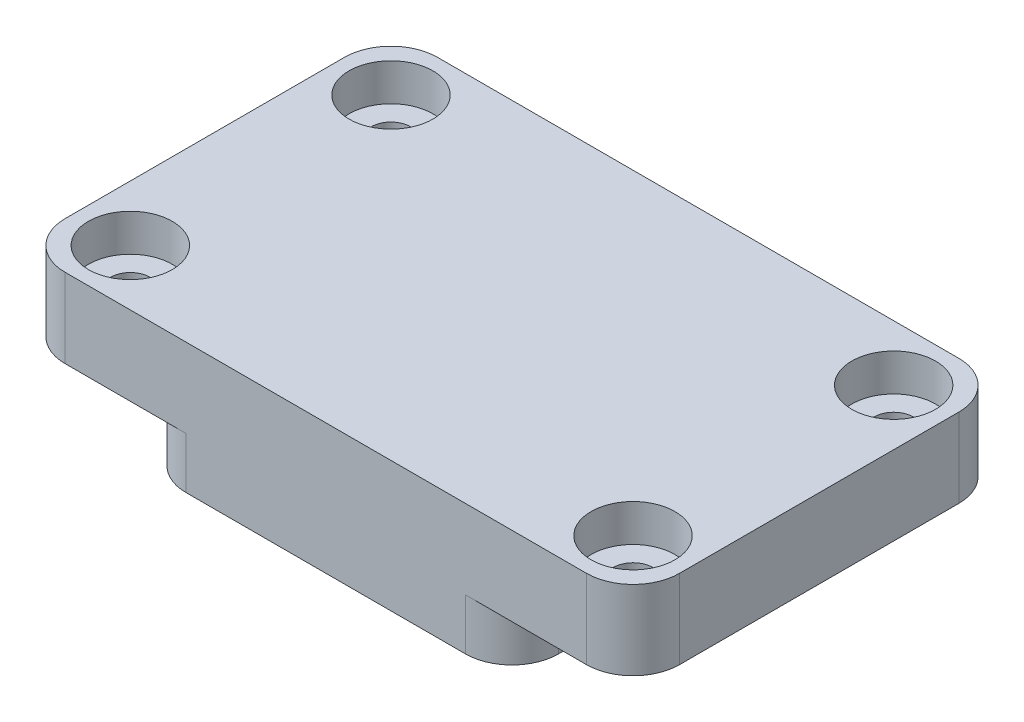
ISO-10303-21;
HEADER;
FILE_DESCRIPTION(('STEP AP214'),'2;1');
FILE_NAME('part.step','',(''),(''),'','','');
FILE_SCHEMA(('AUTOMOTIVE_DESIGN { 1 0 10303 214 1 1 1 1 }'));
ENDSEC;
DATA;
#1=APPLICATION_CONTEXT('core data for automotive mechanical design processes');
#2=APPLICATION_PROTOCOL_DEFINITION('international standard','automotive_design',2000,#1);
#3=PRODUCT_CONTEXT('',#1,'mechanical');
#4=PRODUCT('Part','Part','',(#3));
#5=PRODUCT_RELATED_PRODUCT_CATEGORY('part','',(#4));
#6=PRODUCT_DEFINITION_FORMATION('','',#4);
#7=PRODUCT_DEFINITION_CONTEXT('part definition',#1,'design');
#8=PRODUCT_DEFINITION('design','',#6,#7);
#9=PRODUCT_DEFINITION_SHAPE('','',#8);
#10=(LENGTH_UNIT() NAMED_UNIT(*) SI_UNIT(.MILLI.,.METRE.));
#11=(NAMED_UNIT(*) PLANE_ANGLE_UNIT() SI_UNIT($,.RADIAN.));
#12=(NAMED_UNIT(*) SI_UNIT($,.STERADIAN.) SOLID_ANGLE_UNIT());
#13=UNCERTAINTY_MEASURE_WITH_UNIT(LENGTH_MEASURE(1.E-05),#10,'distance_accuracy_value','');
#14=(GEOMETRIC_REPRESENTATION_CONTEXT(3) GLOBAL_UNCERTAINTY_ASSIGNED_CONTEXT((#13)) GLOBAL_UNIT_ASSIGNED_CONTEXT((#10,
#11,#12)) REPRESENTATION_CONTEXT('',''));
#15=CARTESIAN_POINT('',(0.,0.,0.));
#16=DIRECTION('',(0.,0.,1.));
#17=DIRECTION('',(1.,0.,0.));
#18=AXIS2_PLACEMENT_3D('',#15,#16,#17);
#19=CARTESIAN_POINT('',(-7.5,7.,-7.5));
#20=DIRECTION('',(0.,-1.,0.));
#21=DIRECTION('',(0.,0.,-1.));
#22=AXIS2_PLACEMENT_3D('',#19,#20,#21);
#23=PLANE('',#22);
#24=CARTESIAN_POINT('',(-13.5,7.,7.));
#25=DIRECTION('',(0.,1.,0.));
#26=DIRECTION('',(0.,0.,1.));
#27=AXIS2_PLACEMENT_3D('',#24,#25,#26);
#28=CIRCLE('',#27,2.25);
#29=CARTESIAN_POINT('',(-13.5,7.,9.25));
#30=VERTEX_POINT('',#29);
#31=EDGE_CURVE('E384',#30,#30,#28,.T.);
#32=ORIENTED_EDGE('',*,*,#31,.F.);
#33=EDGE_LOOP('',(#32));
#34=FACE_BOUND('',#33,.T.);
#35=CARTESIAN_POINT('',(-13.5,7.,-7.));
#36=DIRECTION('',(0.,1.,0.));
#37=DIRECTION('',(0.,0.,1.));
#38=AXIS2_PLACEMENT_3D('',#35,#36,#37);
#39=CIRCLE('',#38,2.25);
#40=CARTESIAN_POINT('',(-13.5,7.,-4.75));
#41=VERTEX_POINT('',#40);
#42=EDGE_CURVE('E371',#41,#41,#39,.T.);
#43=ORIENTED_EDGE('',*,*,#42,.F.);
#44=EDGE_LOOP('',(#43));
#45=FACE_BOUND('',#44,.T.);
#46=CARTESIAN_POINT('',(13.5,7.,-7.));
#47=DIRECTION('',(0.,1.,0.));
#48=DIRECTION('',(0.,0.,1.));
#49=AXIS2_PLACEMENT_3D('',#46,#47,#48);
#50=CIRCLE('',#49,2.25);
#51=CARTESIAN_POINT('',(13.5,7.,-4.75));
#52=VERTEX_POINT('',#51);
#53=EDGE_CURVE('E367',#52,#52,#50,.T.);
#54=ORIENTED_EDGE('',*,*,#53,.F.);
#55=EDGE_LOOP('',(#54));
#56=FACE_BOUND('',#55,.T.);
#57=DIRECTION('',(-1.,0.,0.));
#58=VECTOR('',#57,1.);
#59=CARTESIAN_POINT('',(-7.49999999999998,7.,-10.));
#60=LINE('',#59,#58);
#61=CARTESIAN_POINT('',(14.,7.,-10.));
#62=VERTEX_POINT('',#61);
#63=CARTESIAN_POINT('',(-14.,7.,-10.));
#64=VERTEX_POINT('',#63);
#65=EDGE_CURVE('E327',#62,#64,#60,.T.);
#66=ORIENTED_EDGE('',*,*,#65,.T.);
#67=CARTESIAN_POINT('',(-14.,7.,-7.5));
#68=DIRECTION('',(0.,1.,0.));
#69=DIRECTION('',(0.,0.,-1.));
#70=AXIS2_PLACEMENT_3D('',#67,#68,#69);
#71=CIRCLE('',#70,2.5);
#72=CARTESIAN_POINT('',(-16.5,7.,-7.5));
#73=VERTEX_POINT('',#72);
#74=EDGE_CURVE('E241',#64,#73,#71,.T.);
#75=ORIENTED_EDGE('',*,*,#74,.T.);
#76=DIRECTION('',(0.,0.,1.));
#77=VECTOR('',#76,1.);
#78=CARTESIAN_POINT('',(-16.5,7.,-7.5));
#79=LINE('',#78,#77);
#80=CARTESIAN_POINT('',(-16.5,7.,7.50000000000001));
#81=VERTEX_POINT('',#80);
#82=EDGE_CURVE('E273',#73,#81,#79,.T.);
#83=ORIENTED_EDGE('',*,*,#82,.T.);
#84=CARTESIAN_POINT('',(-14.,7.,7.50000000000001));
#85=DIRECTION('',(0.,1.,0.));
#86=DIRECTION('',(0.,0.,1.));
#87=AXIS2_PLACEMENT_3D('',#84,#85,#86);
#88=CIRCLE('',#87,2.5);
#89=CARTESIAN_POINT('',(-14.,7.,10.));
#90=VERTEX_POINT('',#89);
#91=EDGE_CURVE('E250',#81,#90,#88,.T.);
#92=ORIENTED_EDGE('',*,*,#91,.T.);
#93=DIRECTION('',(1.,0.,0.));
#94=VECTOR('',#93,1.);
#95=CARTESIAN_POINT('',(-7.49999999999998,7.,10.));
#96=LINE('',#95,#94);
#97=CARTESIAN_POINT('',(14.,7.,10.));
#98=VERTEX_POINT('',#97);
#99=EDGE_CURVE('E325',#90,#98,#96,.T.);
#100=ORIENTED_EDGE('',*,*,#99,.T.);
#101=CARTESIAN_POINT('',(14.,7.,7.5));
#102=DIRECTION('',(0.,1.,0.));
#103=DIRECTION('',(0.,0.,-1.));
#104=AXIS2_PLACEMENT_3D('',#101,#102,#103);
#105=CIRCLE('',#104,2.5);
#106=CARTESIAN_POINT('',(16.5,7.,7.5));
#107=VERTEX_POINT('',#106);
#108=EDGE_CURVE('E236',#98,#107,#105,.T.);
#109=ORIENTED_EDGE('',*,*,#108,.T.);
#110=DIRECTION('',(0.,0.,-1.));
#111=VECTOR('',#110,1.);
#112=CARTESIAN_POINT('',(16.5,7.,-7.5));
#113=LINE('',#112,#111);
#114=CARTESIAN_POINT('',(16.5,7.,-7.5));
#115=VERTEX_POINT('',#114);
#116=EDGE_CURVE('E193',#107,#115,#113,.T.);
#117=ORIENTED_EDGE('',*,*,#116,.T.);
#118=CARTESIAN_POINT('',(14.,7.,-7.5));
#119=DIRECTION('',(0.,1.,0.));
#120=DIRECTION('',(0.,0.,-1.));
#121=AXIS2_PLACEMENT_3D('',#118,#119,#120);
#122=CIRCLE('',#121,2.5);
#123=EDGE_CURVE('E214',#115,#62,#122,.T.);
#124=ORIENTED_EDGE('',*,*,#123,.T.);
#125=EDGE_LOOP('',(#66,#75,#83,#92,#100,#109,#117,#124));
#126=FACE_BOUND('',#125,.T.);
#127=CARTESIAN_POINT('',(13.5,7.,7.));
#128=DIRECTION('',(0.,1.,0.));
#129=DIRECTION('',(0.,0.,1.));
#130=AXIS2_PLACEMENT_3D('',#127,#128,#129);
#131=CIRCLE('',#130,2.25);
#132=CARTESIAN_POINT('',(13.5,7.,9.25));
#133=VERTEX_POINT('',#132);
#134=EDGE_CURVE('E843',#133,#133,#131,.T.);
#135=ORIENTED_EDGE('',*,*,#134,.F.);
#136=EDGE_LOOP('',(#135));
#137=FACE_BOUND('',#136,.T.);
#138=ADVANCED_FACE('F40',(#34,#45,#56,#126,#137),#23,.F.);
#139=CARTESIAN_POINT('',(-7.5,7.,-7.5));
#140=DIRECTION('',(0.,-1.,0.));
#141=DIRECTION('',(0.,0.,-1.));
#142=AXIS2_PLACEMENT_3D('',#139,#140,#141);
#143=CYLINDRICAL_SURFACE('',#142,2.5);
#144=DIRECTION('',(0.,-1.,0.));
#145=VECTOR('',#144,1.);
#146=CARTESIAN_POINT('',(-10.,7.,-7.49999999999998));
#147=LINE('',#146,#145);
#148=CARTESIAN_POINT('',(-10.,2.75,-7.49999999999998));
#149=VERTEX_POINT('',#148);
#150=CARTESIAN_POINT('',(-10.,0.,-7.49999999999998));
#151=VERTEX_POINT('',#150);
#152=EDGE_CURVE('E11',#149,#151,#147,.T.);
#153=ORIENTED_EDGE('',*,*,#152,.F.);
#154=CARTESIAN_POINT('',(-7.5,2.75,-7.5));
#155=DIRECTION('',(0.,-1.,0.));
#156=DIRECTION('',(0.,0.,1.));
#157=AXIS2_PLACEMENT_3D('',#154,#155,#156);
#158=CIRCLE('',#157,2.5);
#159=CARTESIAN_POINT('',(-7.49999999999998,2.75,-10.));
#160=VERTEX_POINT('',#159);
#161=EDGE_CURVE('E265',#149,#160,#158,.T.);
#162=ORIENTED_EDGE('',*,*,#161,.T.);
#163=DIRECTION('',(0.,-1.,0.));
#164=VECTOR('',#163,1.);
#165=CARTESIAN_POINT('',(-7.49999999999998,7.,-10.));
#166=LINE('',#165,#164);
#167=CARTESIAN_POINT('',(-7.49999999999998,0.,-10.));
#168=VERTEX_POINT('',#167);
#169=EDGE_CURVE('E65',#160,#168,#166,.T.);
#170=ORIENTED_EDGE('',*,*,#169,.T.);
#171=CARTESIAN_POINT('',(-7.5,0.,-7.5));
#172=DIRECTION('',(0.,1.,0.));
#173=DIRECTION('',(0.,0.,-1.));
#174=AXIS2_PLACEMENT_3D('',#171,#172,#173);
#175=CIRCLE('',#174,2.5);
#176=EDGE_CURVE('E324',#168,#151,#175,.T.);
#177=ORIENTED_EDGE('',*,*,#176,.T.);
#178=EDGE_LOOP('',(#153,#162,#170,#177));
#179=FACE_BOUND('',#178,.T.);
#180=ADVANCED_FACE('F42',(#179),#143,.T.);
#181=CARTESIAN_POINT('',(-10.,7.,7.49999999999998));
#182=DIRECTION('',(1.,0.,0.));
#183=DIRECTION('',(0.,0.,-1.));
#184=AXIS2_PLACEMENT_3D('',#181,#182,#183);
#185=PLANE('',#184);
#186=DIRECTION('',(0.,-1.,0.));
#187=VECTOR('',#186,1.);
#188=CARTESIAN_POINT('',(-10.,7.,7.49999999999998));
#189=LINE('',#188,#187);
#190=CARTESIAN_POINT('',(-10.,2.75,7.49999999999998));
#191=VERTEX_POINT('',#190);
#192=CARTESIAN_POINT('',(-10.,0.,7.49999999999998));
#193=VERTEX_POINT('',#192);
#194=EDGE_CURVE('E49',#191,#193,#189,.T.);
#195=ORIENTED_EDGE('',*,*,#194,.F.);
#196=DIRECTION('',(0.,0.,-1.));
#197=VECTOR('',#196,1.);
#198=CARTESIAN_POINT('',(-10.,2.75,-7.49999999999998));
#199=LINE('',#198,#197);
#200=EDGE_CURVE('E262',#191,#149,#199,.T.);
#201=ORIENTED_EDGE('',*,*,#200,.T.);
#202=ORIENTED_EDGE('',*,*,#152,.T.);
#203=DIRECTION('',(0.,0.,1.));
#204=VECTOR('',#203,1.);
#205=CARTESIAN_POINT('',(-10.,0.,7.49999999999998));
#206=LINE('',#205,#204);
#207=EDGE_CURVE('E331',#151,#193,#206,.T.);
#208=ORIENTED_EDGE('',*,*,#207,.T.);
#209=EDGE_LOOP('',(#195,#201,#202,#208));
#210=FACE_BOUND('',#209,.T.);
#211=ADVANCED_FACE('F421',(#210),#185,.F.);
#212=CARTESIAN_POINT('',(-7.5,7.,7.5));
#213=DIRECTION('',(0.,-1.,0.));
#214=DIRECTION('',(0.,0.,-1.));
#215=AXIS2_PLACEMENT_3D('',#212,#213,#214);
#216=CYLINDRICAL_SURFACE('',#215,2.5);
#217=DIRECTION('',(0.,-1.,0.));
#218=VECTOR('',#217,1.);
#219=CARTESIAN_POINT('',(-7.49999999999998,7.,10.));
#220=LINE('',#219,#218);
#221=CARTESIAN_POINT('',(-7.49999999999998,2.75,10.));
#222=VERTEX_POINT('',#221);
#223=CARTESIAN_POINT('',(-7.49999999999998,0.,10.));
#224=VERTEX_POINT('',#223);
#225=EDGE_CURVE('E360',#222,#224,#220,.T.);
#226=ORIENTED_EDGE('',*,*,#225,.F.);
#227=CARTESIAN_POINT('',(-7.5,2.75,7.5));
#228=DIRECTION('',(0.,-1.,0.));
#229=DIRECTION('',(0.,0.,1.));
#230=AXIS2_PLACEMENT_3D('',#227,#228,#229);
#231=CIRCLE('',#230,2.5);
#232=EDGE_CURVE('E259',#222,#191,#231,.T.);
#233=ORIENTED_EDGE('',*,*,#232,.T.);
#234=ORIENTED_EDGE('',*,*,#194,.T.);
#235=CARTESIAN_POINT('',(-7.5,0.,7.5));
#236=DIRECTION('',(0.,1.,0.));
#237=DIRECTION('',(0.,0.,-1.));
#238=AXIS2_PLACEMENT_3D('',#235,#236,#237);
#239=CIRCLE('',#238,2.5);
#240=EDGE_CURVE('E334',#193,#224,#239,.T.);
#241=ORIENTED_EDGE('',*,*,#240,.T.);
#242=EDGE_LOOP('',(#226,#233,#234,#241));
#243=FACE_BOUND('',#242,.T.);
#244=ADVANCED_FACE('F451',(#243),#216,.T.);
#245=CARTESIAN_POINT('',(-7.49999999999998,7.,10.));
#246=DIRECTION('',(0.,0.,-1.));
#247=DIRECTION('',(-1.,0.,0.));
#248=AXIS2_PLACEMENT_3D('',#245,#246,#247);
#249=PLANE('',#248);
#250=DIRECTION('',(1.,0.,0.));
#251=VECTOR('',#250,1.);
#252=CARTESIAN_POINT('',(-7.49999999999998,0.,10.));
#253=LINE('',#252,#251);
#254=CARTESIAN_POINT('',(7.49999999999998,0.,10.));
#255=VERTEX_POINT('',#254);
#256=EDGE_CURVE('E337',#224,#255,#253,.T.);
#257=ORIENTED_EDGE('',*,*,#256,.T.);
#258=DIRECTION('',(0.,-1.,0.));
#259=VECTOR('',#258,1.);
#260=CARTESIAN_POINT('',(7.49999999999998,7.,10.));
#261=LINE('',#260,#259);
#262=CARTESIAN_POINT('',(7.49999999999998,2.75,10.));
#263=VERTEX_POINT('',#262);
#264=EDGE_CURVE('E358',#263,#255,#261,.T.);
#265=ORIENTED_EDGE('',*,*,#264,.F.);
#266=DIRECTION('',(1.,0.,0.));
#267=VECTOR('',#266,1.);
#268=CARTESIAN_POINT('',(14.,2.75,10.));
#269=LINE('',#268,#267);
#270=CARTESIAN_POINT('',(14.,2.75,10.));
#271=VERTEX_POINT('',#270);
#272=EDGE_CURVE('E199',#263,#271,#269,.T.);
#273=ORIENTED_EDGE('',*,*,#272,.T.);
#274=DIRECTION('',(0.,1.,0.));
#275=VECTOR('',#274,1.);
#276=CARTESIAN_POINT('',(14.,2.75,10.));
#277=LINE('',#276,#275);
#278=EDGE_CURVE('E213',#271,#98,#277,.T.);
#279=ORIENTED_EDGE('',*,*,#278,.T.);
#280=ORIENTED_EDGE('',*,*,#99,.F.);
#281=DIRECTION('',(0.,1.,0.));
#282=VECTOR('',#281,1.);
#283=CARTESIAN_POINT('',(-14.,2.75,10.));
#284=LINE('',#283,#282);
#285=CARTESIAN_POINT('',(-14.,2.75,10.));
#286=VERTEX_POINT('',#285);
#287=EDGE_CURVE('E282',#286,#90,#284,.T.);
#288=ORIENTED_EDGE('',*,*,#287,.F.);
#289=DIRECTION('',(1.,0.,0.));
#290=VECTOR('',#289,1.);
#291=CARTESIAN_POINT('',(-7.49999999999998,2.75,10.));
#292=LINE('',#291,#290);
#293=EDGE_CURVE('E256',#286,#222,#292,.T.);
#294=ORIENTED_EDGE('',*,*,#293,.T.);
#295=ORIENTED_EDGE('',*,*,#225,.T.);
#296=EDGE_LOOP('',(#257,#265,#273,#279,#280,#288,#294,#295));
#297=FACE_BOUND('',#296,.T.);
#298=ADVANCED_FACE('F447',(#297),#249,.F.);
#299=CARTESIAN_POINT('',(7.5,7.,7.5));
#300=DIRECTION('',(0.,-1.,0.));
#301=DIRECTION('',(0.,0.,-1.));
#302=AXIS2_PLACEMENT_3D('',#299,#300,#301);
#303=CYLINDRICAL_SURFACE('',#302,2.5);
#304=DIRECTION('',(0.,-1.,0.));
#305=VECTOR('',#304,1.);
#306=CARTESIAN_POINT('',(10.,7.,7.49999999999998));
#307=LINE('',#306,#305);
#308=CARTESIAN_POINT('',(10.,2.75,7.5));
#309=VERTEX_POINT('',#308);
#310=CARTESIAN_POINT('',(10.,0.,7.49999999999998));
#311=VERTEX_POINT('',#310);
#312=EDGE_CURVE('E356',#309,#311,#307,.T.);
#313=ORIENTED_EDGE('',*,*,#312,.F.);
#314=CARTESIAN_POINT('',(7.5,2.75,7.5));
#315=DIRECTION('',(0.,-1.,0.));
#316=DIRECTION('',(0.,0.,1.));
#317=AXIS2_PLACEMENT_3D('',#314,#315,#316);
#318=CIRCLE('',#317,2.5);
#319=EDGE_CURVE('E232',#309,#263,#318,.T.);
#320=ORIENTED_EDGE('',*,*,#319,.T.);
#321=ORIENTED_EDGE('',*,*,#264,.T.);
#322=CARTESIAN_POINT('',(7.5,0.,7.5));
#323=DIRECTION('',(0.,1.,0.));
#324=DIRECTION('',(0.,0.,1.));
#325=AXIS2_PLACEMENT_3D('',#322,#323,#324);
#326=CIRCLE('',#325,2.5);
#327=EDGE_CURVE('E340',#255,#311,#326,.T.);
#328=ORIENTED_EDGE('',*,*,#327,.T.);
#329=EDGE_LOOP('',(#313,#320,#321,#328));
#330=FACE_BOUND('',#329,.T.);
#331=ADVANCED_FACE('F443',(#330),#303,.T.);
#332=CARTESIAN_POINT('',(10.,7.,7.49999999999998));
#333=DIRECTION('',(-1.,0.,0.));
#334=DIRECTION('',(0.,0.,1.));
#335=AXIS2_PLACEMENT_3D('',#332,#333,#334);
#336=PLANE('',#335);
#337=DIRECTION('',(0.,-1.,0.));
#338=VECTOR('',#337,1.);
#339=CARTESIAN_POINT('',(10.,7.,-7.49999999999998));
#340=LINE('',#339,#338);
#341=CARTESIAN_POINT('',(10.,2.75,-7.49999999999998));
#342=VERTEX_POINT('',#341);
#343=CARTESIAN_POINT('',(10.,0.,-7.49999999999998));
#344=VERTEX_POINT('',#343);
#345=EDGE_CURVE('E354',#342,#344,#340,.T.);
#346=ORIENTED_EDGE('',*,*,#345,.F.);
#347=DIRECTION('',(0.,0.,1.));
#348=VECTOR('',#347,1.);
#349=CARTESIAN_POINT('',(10.,2.75,7.5));
#350=LINE('',#349,#348);
#351=EDGE_CURVE('E229',#342,#309,#350,.T.);
#352=ORIENTED_EDGE('',*,*,#351,.T.);
#353=ORIENTED_EDGE('',*,*,#312,.T.);
#354=DIRECTION('',(0.,0.,-1.));
#355=VECTOR('',#354,1.);
#356=CARTESIAN_POINT('',(10.,0.,7.49999999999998));
#357=LINE('',#356,#355);
#358=CARTESIAN_POINT('',(10.,0.,2.7));
#359=VERTEX_POINT('',#358);
#360=EDGE_CURVE('E344',#311,#359,#357,.T.);
#361=ORIENTED_EDGE('',*,*,#360,.T.);
#362=DIRECTION('',(0.,-1.,0.));
#363=VECTOR('',#362,1.);
#364=CARTESIAN_POINT('',(10.,0.,2.7));
#365=LINE('',#364,#363);
#366=CARTESIAN_POINT('',(10.,1.85,2.7));
#367=VERTEX_POINT('',#366);
#368=EDGE_CURVE('E291',#367,#359,#365,.T.);
#369=ORIENTED_EDGE('',*,*,#368,.F.);
#370=DIRECTION('',(0.,0.,1.));
#371=VECTOR('',#370,1.);
#372=CARTESIAN_POINT('',(10.,1.85,2.7));
#373=LINE('',#372,#371);
#374=CARTESIAN_POINT('',(10.,1.85,-3.9));
#375=VERTEX_POINT('',#374);
#376=EDGE_CURVE('E300',#375,#367,#373,.T.);
#377=ORIENTED_EDGE('',*,*,#376,.F.);
#378=DIRECTION('',(0.,1.,0.));
#379=VECTOR('',#378,1.);
#380=CARTESIAN_POINT('',(10.,1.85,-3.9));
#381=LINE('',#380,#379);
#382=CARTESIAN_POINT('',(10.,0.,-3.9));
#383=VERTEX_POINT('',#382);
#384=EDGE_CURVE('E281',#383,#375,#381,.T.);
#385=ORIENTED_EDGE('',*,*,#384,.F.);
#386=EDGE_CURVE('E343',#383,#344,#357,.T.);
#387=ORIENTED_EDGE('',*,*,#386,.T.);
#388=EDGE_LOOP('',(#346,#352,#353,#361,#369,#377,#385,#387));
#389=FACE_BOUND('',#388,.T.);
#390=ADVANCED_FACE('F439',(#389),#336,.F.);
#391=CARTESIAN_POINT('',(7.5,7.,-7.5));
#392=DIRECTION('',(0.,-1.,0.));
#393=DIRECTION('',(0.,0.,-1.));
#394=AXIS2_PLACEMENT_3D('',#391,#392,#393);
#395=CYLINDRICAL_SURFACE('',#394,2.5);
#396=DIRECTION('',(0.,-1.,0.));
#397=VECTOR('',#396,1.);
#398=CARTESIAN_POINT('',(7.49999999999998,7.,-10.));
#399=LINE('',#398,#397);
#400=CARTESIAN_POINT('',(7.49999999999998,2.75,-10.));
#401=VERTEX_POINT('',#400);
#402=CARTESIAN_POINT('',(7.49999999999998,0.,-10.));
#403=VERTEX_POINT('',#402);
#404=EDGE_CURVE('E352',#401,#403,#399,.T.);
#405=ORIENTED_EDGE('',*,*,#404,.F.);
#406=CARTESIAN_POINT('',(7.5,2.75,-7.5));
#407=DIRECTION('',(0.,-1.,0.));
#408=DIRECTION('',(0.,0.,1.));
#409=AXIS2_PLACEMENT_3D('',#406,#407,#408);
#410=CIRCLE('',#409,2.5);
#411=EDGE_CURVE('E226',#401,#342,#410,.T.);
#412=ORIENTED_EDGE('',*,*,#411,.T.);
#413=ORIENTED_EDGE('',*,*,#345,.T.);
#414=CARTESIAN_POINT('',(7.5,0.,-7.5));
#415=DIRECTION('',(0.,1.,0.));
#416=DIRECTION('',(0.,0.,1.));
#417=AXIS2_PLACEMENT_3D('',#414,#415,#416);
#418=CIRCLE('',#417,2.5);
#419=EDGE_CURVE('E347',#344,#403,#418,.T.);
#420=ORIENTED_EDGE('',*,*,#419,.T.);
#421=EDGE_LOOP('',(#405,#412,#413,#420));
#422=FACE_BOUND('',#421,.T.);
#423=ADVANCED_FACE('F435',(#422),#395,.T.);
#424=CARTESIAN_POINT('',(-7.49999999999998,7.,-10.));
#425=DIRECTION('',(0.,0.,1.));
#426=DIRECTION('',(1.,0.,0.));
#427=AXIS2_PLACEMENT_3D('',#424,#425,#426);
#428=PLANE('',#427);
#429=DIRECTION('',(-1.,0.,0.));
#430=VECTOR('',#429,1.);
#431=CARTESIAN_POINT('',(-7.49999999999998,0.,-10.));
#432=LINE('',#431,#430);
#433=EDGE_CURVE('E328',#403,#168,#432,.T.);
#434=ORIENTED_EDGE('',*,*,#433,.T.);
#435=ORIENTED_EDGE('',*,*,#169,.F.);
#436=DIRECTION('',(-1.,0.,0.));
#437=VECTOR('',#436,1.);
#438=CARTESIAN_POINT('',(-14.,2.75,-10.));
#439=LINE('',#438,#437);
#440=CARTESIAN_POINT('',(-14.,2.75,-10.));
#441=VERTEX_POINT('',#440);
#442=EDGE_CURVE('E267',#160,#441,#439,.T.);
#443=ORIENTED_EDGE('',*,*,#442,.T.);
#444=DIRECTION('',(0.,1.,0.));
#445=VECTOR('',#444,1.);
#446=CARTESIAN_POINT('',(-14.,2.75,-10.));
#447=LINE('',#446,#445);
#448=EDGE_CURVE('E278',#441,#64,#447,.T.);
#449=ORIENTED_EDGE('',*,*,#448,.T.);
#450=ORIENTED_EDGE('',*,*,#65,.F.);
#451=DIRECTION('',(0.,1.,0.));
#452=VECTOR('',#451,1.);
#453=CARTESIAN_POINT('',(14.,2.75,-10.));
#454=LINE('',#453,#452);
#455=CARTESIAN_POINT('',(14.,2.75,-10.));
#456=VERTEX_POINT('',#455);
#457=EDGE_CURVE('E242',#456,#62,#454,.T.);
#458=ORIENTED_EDGE('',*,*,#457,.F.);
#459=DIRECTION('',(-1.,0.,0.));
#460=VECTOR('',#459,1.);
#461=CARTESIAN_POINT('',(7.49999999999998,2.75,-10.));
#462=LINE('',#461,#460);
#463=EDGE_CURVE('E223',#456,#401,#462,.T.);
#464=ORIENTED_EDGE('',*,*,#463,.T.);
#465=ORIENTED_EDGE('',*,*,#404,.T.);
#466=EDGE_LOOP('',(#434,#435,#443,#449,#450,#458,#464,#465));
#467=FACE_BOUND('',#466,.T.);
#468=ADVANCED_FACE('F431',(#467),#428,.F.);
#469=CARTESIAN_POINT('',(-7.5,0.,-7.5));
#470=DIRECTION('',(0.,-1.,0.));
#471=DIRECTION('',(0.,0.,-1.));
#472=AXIS2_PLACEMENT_3D('',#469,#470,#471);
#473=PLANE('',#472);
#474=DIRECTION('',(1.,0.,0.));
#475=VECTOR('',#474,1.);
#476=CARTESIAN_POINT('',(5.75,0.,2.7));
#477=LINE('',#476,#475);
#478=CARTESIAN_POINT('',(5.75,0.,2.7));
#479=VERTEX_POINT('',#478);
#480=EDGE_CURVE('E304',#479,#359,#477,.T.);
#481=ORIENTED_EDGE('',*,*,#480,.T.);
#482=ORIENTED_EDGE('',*,*,#360,.F.);
#483=ORIENTED_EDGE('',*,*,#327,.F.);
#484=ORIENTED_EDGE('',*,*,#256,.F.);
#485=ORIENTED_EDGE('',*,*,#240,.F.);
#486=ORIENTED_EDGE('',*,*,#207,.F.);
#487=ORIENTED_EDGE('',*,*,#176,.F.);
#488=ORIENTED_EDGE('',*,*,#433,.F.);
#489=ORIENTED_EDGE('',*,*,#419,.F.);
#490=ORIENTED_EDGE('',*,*,#386,.F.);
#491=DIRECTION('',(1.,0.,0.));
#492=VECTOR('',#491,1.);
#493=CARTESIAN_POINT('',(5.75,0.,-3.9));
#494=LINE('',#493,#492);
#495=CARTESIAN_POINT('',(5.75,0.,-3.9));
#496=VERTEX_POINT('',#495);
#497=EDGE_CURVE('E297',#496,#383,#494,.T.);
#498=ORIENTED_EDGE('',*,*,#497,.F.);
#499=DIRECTION('',(0.,0.,-1.));
#500=VECTOR('',#499,1.);
#501=CARTESIAN_POINT('',(5.75,0.,2.7));
#502=LINE('',#501,#500);
#503=EDGE_CURVE('E288',#479,#496,#502,.T.);
#504=ORIENTED_EDGE('',*,*,#503,.F.);
#505=EDGE_LOOP('',(#481,#482,#483,#484,#485,#486,#487,#488,#489,#490,#498,#504));
#506=FACE_BOUND('',#505,.T.);
#507=CARTESIAN_POINT('',(5.5,0.,5.5));
#508=DIRECTION('',(0.,-1.,0.));
#509=DIRECTION('',(0.,0.,-1.));
#510=AXIS2_PLACEMENT_3D('',#507,#508,#509);
#511=CIRCLE('',#510,0.62499999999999);
#512=CARTESIAN_POINT('',(5.5,0.,4.87500000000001));
#513=VERTEX_POINT('',#512);
#514=EDGE_CURVE('E307',#513,#513,#511,.T.);
#515=ORIENTED_EDGE('',*,*,#514,.F.);
#516=EDGE_LOOP('',(#515));
#517=FACE_BOUND('',#516,.T.);
#518=CARTESIAN_POINT('',(-5.5,0.,-5.5));
#519=DIRECTION('',(0.,-1.,0.));
#520=DIRECTION('',(0.,0.,-1.));
#521=AXIS2_PLACEMENT_3D('',#518,#519,#520);
#522=CIRCLE('',#521,0.62499999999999);
#523=CARTESIAN_POINT('',(-5.5,0.,-6.12499999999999));
#524=VERTEX_POINT('',#523);
#525=EDGE_CURVE('E318',#524,#524,#522,.T.);
#526=ORIENTED_EDGE('',*,*,#525,.F.);
#527=EDGE_LOOP('',(#526));
#528=FACE_BOUND('',#527,.T.);
#529=ADVANCED_FACE('F428',(#506,#517,#528),#473,.T.);
#530=CARTESIAN_POINT('',(-5.5,5.25,-5.5));
#531=DIRECTION('',(0.,-1.,0.));
#532=DIRECTION('',(0.,0.,-1.));
#533=AXIS2_PLACEMENT_3D('',#530,#531,#532);
#534=CONICAL_SURFACE('',#533,0.624999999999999,1.02974425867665);
#535=CARTESIAN_POINT('',(-5.50000000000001,5.62553788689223,-5.5));
#536=VERTEX_POINT('',#535);
#537=VERTEX_LOOP('',#536);
#538=FACE_BOUND('',#537,.T.);
#539=CARTESIAN_POINT('',(-5.5,5.25,-5.5));
#540=DIRECTION('',(0.,-1.,0.));
#541=DIRECTION('',(0.,0.,-1.));
#542=AXIS2_PLACEMENT_3D('',#539,#540,#541);
#543=CIRCLE('',#542,0.624999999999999);
#544=CARTESIAN_POINT('',(-5.5,5.25,-6.125));
#545=VERTEX_POINT('',#544);
#546=EDGE_CURVE('E321',#545,#545,#543,.T.);
#547=ORIENTED_EDGE('',*,*,#546,.T.);
#548=EDGE_LOOP('',(#547));
#549=FACE_BOUND('',#548,.T.);
#550=ADVANCED_FACE('F426',(#538,#549),#534,.F.);
#551=CARTESIAN_POINT('',(-5.5,0.,-5.5));
#552=DIRECTION('',(0.,-1.,0.));
#553=DIRECTION('',(0.,0.,-1.));
#554=AXIS2_PLACEMENT_3D('',#551,#552,#553);
#555=CYLINDRICAL_SURFACE('',#554,0.624999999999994);
#556=ORIENTED_EDGE('',*,*,#546,.F.);
#557=EDGE_LOOP('',(#556));
#558=FACE_BOUND('',#557,.T.);
#559=ORIENTED_EDGE('',*,*,#525,.T.);
#560=EDGE_LOOP('',(#559));
#561=FACE_BOUND('',#560,.T.);
#562=ADVANCED_FACE('F538',(#558,#561),#555,.F.);
#563=CARTESIAN_POINT('',(5.5,5.25,5.5));
#564=DIRECTION('',(0.,-1.,0.));
#565=DIRECTION('',(0.,0.,-1.));
#566=AXIS2_PLACEMENT_3D('',#563,#564,#565);
#567=CONICAL_SURFACE('',#566,0.624999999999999,1.02974425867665);
#568=CARTESIAN_POINT('',(5.5,5.62553788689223,5.5));
#569=VERTEX_POINT('',#568);
#570=VERTEX_LOOP('',#569);
#571=FACE_BOUND('',#570,.T.);
#572=CARTESIAN_POINT('',(5.5,5.25,5.5));
#573=DIRECTION('',(0.,-1.,0.));
#574=DIRECTION('',(0.,0.,-1.));
#575=AXIS2_PLACEMENT_3D('',#572,#573,#574);
#576=CIRCLE('',#575,0.624999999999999);
#577=CARTESIAN_POINT('',(5.5,5.25,4.875));
#578=VERTEX_POINT('',#577);
#579=EDGE_CURVE('E315',#578,#578,#576,.T.);
#580=ORIENTED_EDGE('',*,*,#579,.T.);
#581=EDGE_LOOP('',(#580));
#582=FACE_BOUND('',#581,.T.);
#583=ADVANCED_FACE('F535',(#571,#582),#567,.F.);
#584=CARTESIAN_POINT('',(5.5,0.,5.5));
#585=DIRECTION('',(0.,-1.,0.));
#586=DIRECTION('',(0.,0.,-1.));
#587=AXIS2_PLACEMENT_3D('',#584,#585,#586);
#588=CYLINDRICAL_SURFACE('',#587,0.624999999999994);
#589=ORIENTED_EDGE('',*,*,#579,.F.);
#590=EDGE_LOOP('',(#589));
#591=FACE_BOUND('',#590,.T.);
#592=ORIENTED_EDGE('',*,*,#514,.T.);
#593=EDGE_LOOP('',(#592));
#594=FACE_BOUND('',#593,.T.);
#595=ADVANCED_FACE('F525',(#591,#594),#588,.F.);
#596=CARTESIAN_POINT('',(5.75,0.,2.7));
#597=DIRECTION('',(0.,0.,1.));
#598=DIRECTION('',(0.,-1.,0.));
#599=AXIS2_PLACEMENT_3D('',#596,#597,#598);
#600=PLANE('',#599);
#601=ORIENTED_EDGE('',*,*,#368,.T.);
#602=ORIENTED_EDGE('',*,*,#480,.F.);
#603=DIRECTION('',(0.,-1.,0.));
#604=VECTOR('',#603,1.);
#605=CARTESIAN_POINT('',(5.75,0.,2.7));
#606=LINE('',#605,#604);
#607=CARTESIAN_POINT('',(5.75,1.85,2.7));
#608=VERTEX_POINT('',#607);
#609=EDGE_CURVE('E57',#608,#479,#606,.T.);
#610=ORIENTED_EDGE('',*,*,#609,.F.);
#611=DIRECTION('',(1.,0.,0.));
#612=VECTOR('',#611,1.);
#613=CARTESIAN_POINT('',(5.75,1.85,2.7));
#614=LINE('',#613,#612);
#615=EDGE_CURVE('E308',#608,#367,#614,.T.);
#616=ORIENTED_EDGE('',*,*,#615,.T.);
#617=EDGE_LOOP('',(#601,#602,#610,#616));
#618=FACE_BOUND('',#617,.T.);
#619=ADVANCED_FACE('F521',(#618),#600,.F.);
#620=CARTESIAN_POINT('',(5.75,1.85,2.7));
#621=DIRECTION('',(0.,1.,0.));
#622=DIRECTION('',(0.,0.,1.));
#623=AXIS2_PLACEMENT_3D('',#620,#621,#622);
#624=PLANE('',#623);
#625=ORIENTED_EDGE('',*,*,#376,.T.);
#626=ORIENTED_EDGE('',*,*,#615,.F.);
#627=DIRECTION('',(0.,0.,1.));
#628=VECTOR('',#627,1.);
#629=CARTESIAN_POINT('',(5.75,1.85,2.7));
#630=LINE('',#629,#628);
#631=CARTESIAN_POINT('',(5.75,1.85,-3.9));
#632=VERTEX_POINT('',#631);
#633=EDGE_CURVE('E294',#632,#608,#630,.T.);
#634=ORIENTED_EDGE('',*,*,#633,.F.);
#635=DIRECTION('',(1.,0.,0.));
#636=VECTOR('',#635,1.);
#637=CARTESIAN_POINT('',(5.75,1.85,-3.9));
#638=LINE('',#637,#636);
#639=EDGE_CURVE('E310',#632,#375,#638,.T.);
#640=ORIENTED_EDGE('',*,*,#639,.T.);
#641=EDGE_LOOP('',(#625,#626,#634,#640));
#642=FACE_BOUND('',#641,.T.);
#643=ADVANCED_FACE('F524',(#642),#624,.F.);
#644=CARTESIAN_POINT('',(5.75,1.85,-3.9));
#645=DIRECTION('',(0.,0.,-1.));
#646=DIRECTION('',(0.,1.,0.));
#647=AXIS2_PLACEMENT_3D('',#644,#645,#646);
#648=PLANE('',#647);
#649=ORIENTED_EDGE('',*,*,#384,.T.);
#650=ORIENTED_EDGE('',*,*,#639,.F.);
#651=DIRECTION('',(0.,1.,0.));
#652=VECTOR('',#651,1.);
#653=CARTESIAN_POINT('',(5.75,1.85,-3.9));
#654=LINE('',#653,#652);
#655=EDGE_CURVE('E290',#496,#632,#654,.T.);
#656=ORIENTED_EDGE('',*,*,#655,.F.);
#657=ORIENTED_EDGE('',*,*,#497,.T.);
#658=EDGE_LOOP('',(#649,#650,#656,#657));
#659=FACE_BOUND('',#658,.T.);
#660=ADVANCED_FACE('F520',(#659),#648,.F.);
#661=CARTESIAN_POINT('',(5.75,0.,0.));
#662=DIRECTION('',(-1.,0.,0.));
#663=DIRECTION('',(0.,0.,1.));
#664=AXIS2_PLACEMENT_3D('',#661,#662,#663);
#665=PLANE('',#664);
#666=ORIENTED_EDGE('',*,*,#503,.T.);
#667=ORIENTED_EDGE('',*,*,#655,.T.);
#668=ORIENTED_EDGE('',*,*,#633,.T.);
#669=ORIENTED_EDGE('',*,*,#609,.T.);
#670=EDGE_LOOP('',(#666,#667,#668,#669));
#671=FACE_BOUND('',#670,.T.);
#672=ADVANCED_FACE('F517',(#671),#665,.F.);
#673=CARTESIAN_POINT('',(-14.,2.75,-7.5));
#674=DIRECTION('',(0.,1.,0.));
#675=DIRECTION('',(0.,0.,1.));
#676=AXIS2_PLACEMENT_3D('',#673,#674,#675);
#677=CYLINDRICAL_SURFACE('',#676,2.5);
#678=ORIENTED_EDGE('',*,*,#74,.F.);
#679=ORIENTED_EDGE('',*,*,#448,.F.);
#680=CARTESIAN_POINT('',(-14.,2.75,-7.5));
#681=DIRECTION('',(0.,1.,0.));
#682=DIRECTION('',(0.,0.,-1.));
#683=AXIS2_PLACEMENT_3D('',#680,#681,#682);
#684=CIRCLE('',#683,2.5);
#685=CARTESIAN_POINT('',(-16.5,2.75,-7.5));
#686=VERTEX_POINT('',#685);
#687=EDGE_CURVE('E246',#441,#686,#684,.T.);
#688=ORIENTED_EDGE('',*,*,#687,.T.);
#689=DIRECTION('',(0.,1.,0.));
#690=VECTOR('',#689,1.);
#691=CARTESIAN_POINT('',(-16.5,2.75,-7.5));
#692=LINE('',#691,#690);
#693=EDGE_CURVE('E270',#686,#73,#692,.T.);
#694=ORIENTED_EDGE('',*,*,#693,.T.);
#695=EDGE_LOOP('',(#678,#679,#688,#694));
#696=FACE_BOUND('',#695,.T.);
#697=ADVANCED_FACE('F481',(#696),#677,.T.);
#698=CARTESIAN_POINT('',(-14.,2.75,7.50000000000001));
#699=DIRECTION('',(0.,1.,0.));
#700=DIRECTION('',(0.,0.,1.));
#701=AXIS2_PLACEMENT_3D('',#698,#699,#700);
#702=CYLINDRICAL_SURFACE('',#701,2.5);
#703=ORIENTED_EDGE('',*,*,#91,.F.);
#704=DIRECTION('',(0.,1.,0.));
#705=VECTOR('',#704,1.);
#706=CARTESIAN_POINT('',(-16.5,2.75,7.50000000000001));
#707=LINE('',#706,#705);
#708=CARTESIAN_POINT('',(-16.5,2.75,7.50000000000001));
#709=VERTEX_POINT('',#708);
#710=EDGE_CURVE('E285',#709,#81,#707,.T.);
#711=ORIENTED_EDGE('',*,*,#710,.F.);
#712=CARTESIAN_POINT('',(-14.,2.75,7.50000000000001));
#713=DIRECTION('',(0.,1.,0.));
#714=DIRECTION('',(0.,0.,1.));
#715=AXIS2_PLACEMENT_3D('',#712,#713,#714);
#716=CIRCLE('',#715,2.5);
#717=EDGE_CURVE('E253',#709,#286,#716,.T.);
#718=ORIENTED_EDGE('',*,*,#717,.T.);
#719=ORIENTED_EDGE('',*,*,#287,.T.);
#720=EDGE_LOOP('',(#703,#711,#718,#719));
#721=FACE_BOUND('',#720,.T.);
#722=ADVANCED_FACE('F472',(#721),#702,.T.);
#723=CARTESIAN_POINT('',(-16.5,2.75,-7.5));
#724=DIRECTION('',(-1.,0.,0.));
#725=DIRECTION('',(0.,0.,1.));
#726=AXIS2_PLACEMENT_3D('',#723,#724,#725);
#727=PLANE('',#726);
#728=ORIENTED_EDGE('',*,*,#82,.F.);
#729=ORIENTED_EDGE('',*,*,#693,.F.);
#730=DIRECTION('',(0.,0.,1.));
#731=VECTOR('',#730,1.);
#732=CARTESIAN_POINT('',(-16.5,2.75,-7.5));
#733=LINE('',#732,#731);
#734=EDGE_CURVE('E249',#686,#709,#733,.T.);
#735=ORIENTED_EDGE('',*,*,#734,.T.);
#736=ORIENTED_EDGE('',*,*,#710,.T.);
#737=EDGE_LOOP('',(#728,#729,#735,#736));
#738=FACE_BOUND('',#737,.T.);
#739=ADVANCED_FACE('F478',(#738),#727,.T.);
#740=CARTESIAN_POINT('',(-14.,2.75,-7.5));
#741=DIRECTION('',(0.,-1.,0.));
#742=DIRECTION('',(0.,0.,-1.));
#743=AXIS2_PLACEMENT_3D('',#740,#741,#742);
#744=PLANE('',#743);
#745=CARTESIAN_POINT('',(-13.5,2.75,7.));
#746=DIRECTION('',(0.,-1.,0.));
#747=DIRECTION('',(0.,0.,-1.));
#748=AXIS2_PLACEMENT_3D('',#745,#746,#747);
#749=CIRCLE('',#748,1.05);
#750=CARTESIAN_POINT('',(-13.5,2.75,5.95));
#751=VERTEX_POINT('',#750);
#752=EDGE_CURVE('E369',#751,#751,#749,.T.);
#753=ORIENTED_EDGE('',*,*,#752,.F.);
#754=EDGE_LOOP('',(#753));
#755=FACE_BOUND('',#754,.T.);
#756=CARTESIAN_POINT('',(-13.5,2.75,-7.));
#757=DIRECTION('',(0.,-1.,0.));
#758=DIRECTION('',(0.,0.,-1.));
#759=AXIS2_PLACEMENT_3D('',#756,#757,#758);
#760=CIRCLE('',#759,1.05);
#761=CARTESIAN_POINT('',(-13.5,2.75,-8.05));
#762=VERTEX_POINT('',#761);
#763=EDGE_CURVE('E365',#762,#762,#760,.T.);
#764=ORIENTED_EDGE('',*,*,#763,.F.);
#765=EDGE_LOOP('',(#764));
#766=FACE_BOUND('',#765,.T.);
#767=ORIENTED_EDGE('',*,*,#687,.F.);
#768=ORIENTED_EDGE('',*,*,#442,.F.);
#769=ORIENTED_EDGE('',*,*,#161,.F.);
#770=ORIENTED_EDGE('',*,*,#200,.F.);
#771=ORIENTED_EDGE('',*,*,#232,.F.);
#772=ORIENTED_EDGE('',*,*,#293,.F.);
#773=ORIENTED_EDGE('',*,*,#717,.F.);
#774=ORIENTED_EDGE('',*,*,#734,.F.);
#775=EDGE_LOOP('',(#767,#768,#769,#770,#771,#772,#773,#774));
#776=FACE_BOUND('',#775,.T.);
#777=ADVANCED_FACE('F468',(#755,#766,#776),#744,.T.);
#778=CARTESIAN_POINT('',(14.,2.75,7.5));
#779=DIRECTION('',(0.,1.,0.));
#780=DIRECTION('',(0.,0.,1.));
#781=AXIS2_PLACEMENT_3D('',#778,#779,#780);
#782=CYLINDRICAL_SURFACE('',#781,2.5);
#783=ORIENTED_EDGE('',*,*,#108,.F.);
#784=ORIENTED_EDGE('',*,*,#278,.F.);
#785=CARTESIAN_POINT('',(14.,2.75,7.5));
#786=DIRECTION('',(0.,1.,0.));
#787=DIRECTION('',(0.,0.,-1.));
#788=AXIS2_PLACEMENT_3D('',#785,#786,#787);
#789=CIRCLE('',#788,2.5);
#790=CARTESIAN_POINT('',(16.5,2.75,7.5));
#791=VERTEX_POINT('',#790);
#792=EDGE_CURVE('E205',#271,#791,#789,.T.);
#793=ORIENTED_EDGE('',*,*,#792,.T.);
#794=DIRECTION('',(0.,1.,0.));
#795=VECTOR('',#794,1.);
#796=CARTESIAN_POINT('',(16.5,2.75,7.5));
#797=LINE('',#796,#795);
#798=EDGE_CURVE('E188',#791,#107,#797,.T.);
#799=ORIENTED_EDGE('',*,*,#798,.T.);
#800=EDGE_LOOP('',(#783,#784,#793,#799));
#801=FACE_BOUND('',#800,.T.);
#802=ADVANCED_FACE('F211',(#801),#782,.T.);
#803=CARTESIAN_POINT('',(14.,2.75,-7.5));
#804=DIRECTION('',(0.,1.,0.));
#805=DIRECTION('',(0.,0.,1.));
#806=AXIS2_PLACEMENT_3D('',#803,#804,#805);
#807=CYLINDRICAL_SURFACE('',#806,2.5);
#808=ORIENTED_EDGE('',*,*,#123,.F.);
#809=DIRECTION('',(0.,1.,0.));
#810=VECTOR('',#809,1.);
#811=CARTESIAN_POINT('',(16.5,2.75,-7.5));
#812=LINE('',#811,#810);
#813=CARTESIAN_POINT('',(16.5,2.75,-7.5));
#814=VERTEX_POINT('',#813);
#815=EDGE_CURVE('E198',#814,#115,#812,.T.);
#816=ORIENTED_EDGE('',*,*,#815,.F.);
#817=CARTESIAN_POINT('',(14.,2.75,-7.5));
#818=DIRECTION('',(0.,1.,0.));
#819=DIRECTION('',(0.,0.,-1.));
#820=AXIS2_PLACEMENT_3D('',#817,#818,#819);
#821=CIRCLE('',#820,2.5);
#822=EDGE_CURVE('E209',#814,#456,#821,.T.);
#823=ORIENTED_EDGE('',*,*,#822,.T.);
#824=ORIENTED_EDGE('',*,*,#457,.T.);
#825=EDGE_LOOP('',(#808,#816,#823,#824));
#826=FACE_BOUND('',#825,.T.);
#827=ADVANCED_FACE('F497',(#826),#807,.T.);
#828=CARTESIAN_POINT('',(16.5,2.75,-7.5));
#829=DIRECTION('',(1.,0.,0.));
#830=DIRECTION('',(0.,0.,-1.));
#831=AXIS2_PLACEMENT_3D('',#828,#829,#830);
#832=PLANE('',#831);
#833=ORIENTED_EDGE('',*,*,#116,.F.);
#834=ORIENTED_EDGE('',*,*,#798,.F.);
#835=DIRECTION('',(0.,0.,-1.));
#836=VECTOR('',#835,1.);
#837=CARTESIAN_POINT('',(16.5,2.75,-7.5));
#838=LINE('',#837,#836);
#839=EDGE_CURVE('E191',#791,#814,#838,.T.);
#840=ORIENTED_EDGE('',*,*,#839,.T.);
#841=ORIENTED_EDGE('',*,*,#815,.T.);
#842=EDGE_LOOP('',(#833,#834,#840,#841));
#843=FACE_BOUND('',#842,.T.);
#844=ADVANCED_FACE('F190',(#843),#832,.T.);
#845=CARTESIAN_POINT('',(14.,2.75,7.5));
#846=DIRECTION('',(0.,-1.,0.));
#847=DIRECTION('',(0.,0.,-1.));
#848=AXIS2_PLACEMENT_3D('',#845,#846,#847);
#849=PLANE('',#848);
#850=CARTESIAN_POINT('',(13.5,2.75,7.));
#851=DIRECTION('',(0.,-1.,0.));
#852=DIRECTION('',(0.,0.,-1.));
#853=AXIS2_PLACEMENT_3D('',#850,#851,#852);
#854=CIRCLE('',#853,1.05);
#855=CARTESIAN_POINT('',(13.5,2.75,5.95));
#856=VERTEX_POINT('',#855);
#857=EDGE_CURVE('E44',#856,#856,#854,.T.);
#858=ORIENTED_EDGE('',*,*,#857,.F.);
#859=EDGE_LOOP('',(#858));
#860=FACE_BOUND('',#859,.T.);
#861=CARTESIAN_POINT('',(13.5,2.75,-7.));
#862=DIRECTION('',(0.,-1.,0.));
#863=DIRECTION('',(0.,0.,-1.));
#864=AXIS2_PLACEMENT_3D('',#861,#862,#863);
#865=CIRCLE('',#864,1.05);
#866=CARTESIAN_POINT('',(13.5,2.75,-8.05));
#867=VERTEX_POINT('',#866);
#868=EDGE_CURVE('E238',#867,#867,#865,.T.);
#869=ORIENTED_EDGE('',*,*,#868,.F.);
#870=EDGE_LOOP('',(#869));
#871=FACE_BOUND('',#870,.T.);
#872=ORIENTED_EDGE('',*,*,#792,.F.);
#873=ORIENTED_EDGE('',*,*,#272,.F.);
#874=ORIENTED_EDGE('',*,*,#319,.F.);
#875=ORIENTED_EDGE('',*,*,#351,.F.);
#876=ORIENTED_EDGE('',*,*,#411,.F.);
#877=ORIENTED_EDGE('',*,*,#463,.F.);
#878=ORIENTED_EDGE('',*,*,#822,.F.);
#879=ORIENTED_EDGE('',*,*,#839,.F.);
#880=EDGE_LOOP('',(#872,#873,#874,#875,#876,#877,#878,#879));
#881=FACE_BOUND('',#880,.T.);
#882=ADVANCED_FACE('F204',(#860,#871,#881),#849,.T.);
#883=CARTESIAN_POINT('',(13.5,7.,-7.));
#884=DIRECTION('',(0.,1.,0.));
#885=DIRECTION('',(0.,0.,1.));
#886=AXIS2_PLACEMENT_3D('',#883,#884,#885);
#887=CYLINDRICAL_SURFACE('',#886,1.05);
#888=ORIENTED_EDGE('',*,*,#868,.T.);
#889=EDGE_LOOP('',(#888));
#890=FACE_BOUND('',#889,.T.);
#891=CARTESIAN_POINT('',(13.5,5.,-7.));
#892=DIRECTION('',(0.,1.,0.));
#893=DIRECTION('',(0.,0.,1.));
#894=AXIS2_PLACEMENT_3D('',#891,#892,#893);
#895=CIRCLE('',#894,1.05);
#896=CARTESIAN_POINT('',(13.5,5.,-5.95));
#897=VERTEX_POINT('',#896);
#898=EDGE_CURVE('E219',#897,#897,#895,.T.);
#899=ORIENTED_EDGE('',*,*,#898,.T.);
#900=EDGE_LOOP('',(#899));
#901=FACE_BOUND('',#900,.T.);
#902=ADVANCED_FACE('F400',(#890,#901),#887,.F.);
#903=CARTESIAN_POINT('',(14.55,5.,-7.));
#904=DIRECTION('',(0.,-1.,0.));
#905=DIRECTION('',(0.,0.,-1.));
#906=AXIS2_PLACEMENT_3D('',#903,#904,#905);
#907=PLANE('',#906);
#908=ORIENTED_EDGE('',*,*,#898,.F.);
#909=EDGE_LOOP('',(#908));
#910=FACE_BOUND('',#909,.T.);
#911=CARTESIAN_POINT('',(13.5,5.,-7.));
#912=DIRECTION('',(0.,1.,0.));
#913=DIRECTION('',(0.,0.,1.));
#914=AXIS2_PLACEMENT_3D('',#911,#912,#913);
#915=CIRCLE('',#914,2.25);
#916=CARTESIAN_POINT('',(13.5,5.,-4.75));
#917=VERTEX_POINT('',#916);
#918=EDGE_CURVE('E393',#917,#917,#915,.T.);
#919=ORIENTED_EDGE('',*,*,#918,.T.);
#920=EDGE_LOOP('',(#919));
#921=FACE_BOUND('',#920,.T.);
#922=ADVANCED_FACE('F402',(#910,#921),#907,.F.);
#923=CARTESIAN_POINT('',(13.5,7.,-7.));
#924=DIRECTION('',(0.,1.,0.));
#925=DIRECTION('',(0.,0.,1.));
#926=AXIS2_PLACEMENT_3D('',#923,#924,#925);
#927=CYLINDRICAL_SURFACE('',#926,2.25);
#928=ORIENTED_EDGE('',*,*,#918,.F.);
#929=EDGE_LOOP('',(#928));
#930=FACE_BOUND('',#929,.T.);
#931=ORIENTED_EDGE('',*,*,#53,.T.);
#932=EDGE_LOOP('',(#931));
#933=FACE_BOUND('',#932,.T.);
#934=ADVANCED_FACE('F404',(#930,#933),#927,.F.);
#935=CARTESIAN_POINT('',(-13.5,7.,-7.));
#936=DIRECTION('',(0.,1.,0.));
#937=DIRECTION('',(0.,0.,1.));
#938=AXIS2_PLACEMENT_3D('',#935,#936,#937);
#939=CYLINDRICAL_SURFACE('',#938,1.05);
#940=ORIENTED_EDGE('',*,*,#763,.T.);
#941=EDGE_LOOP('',(#940));
#942=FACE_BOUND('',#941,.T.);
#943=CARTESIAN_POINT('',(-13.5,5.,-7.));
#944=DIRECTION('',(0.,1.,0.));
#945=DIRECTION('',(0.,0.,1.));
#946=AXIS2_PLACEMENT_3D('',#943,#944,#945);
#947=CIRCLE('',#946,1.05);
#948=CARTESIAN_POINT('',(-13.5,5.,-5.95));
#949=VERTEX_POINT('',#948);
#950=EDGE_CURVE('E368',#949,#949,#947,.T.);
#951=ORIENTED_EDGE('',*,*,#950,.T.);
#952=EDGE_LOOP('',(#951));
#953=FACE_BOUND('',#952,.T.);
#954=ADVANCED_FACE('F410',(#942,#953),#939,.F.);
#955=CARTESIAN_POINT('',(-12.45,5.,-7.));
#956=DIRECTION('',(0.,-1.,0.));
#957=DIRECTION('',(0.,0.,-1.));
#958=AXIS2_PLACEMENT_3D('',#955,#956,#957);
#959=PLANE('',#958);
#960=ORIENTED_EDGE('',*,*,#950,.F.);
#961=EDGE_LOOP('',(#960));
#962=FACE_BOUND('',#961,.T.);
#963=CARTESIAN_POINT('',(-13.5,5.,-7.));
#964=DIRECTION('',(0.,1.,0.));
#965=DIRECTION('',(0.,0.,1.));
#966=AXIS2_PLACEMENT_3D('',#963,#964,#965);
#967=CIRCLE('',#966,2.25);
#968=CARTESIAN_POINT('',(-13.5,5.,-4.75));
#969=VERTEX_POINT('',#968);
#970=EDGE_CURVE('E376',#969,#969,#967,.T.);
#971=ORIENTED_EDGE('',*,*,#970,.T.);
#972=EDGE_LOOP('',(#971));
#973=FACE_BOUND('',#972,.T.);
#974=ADVANCED_FACE('F754',(#962,#973),#959,.F.);
#975=CARTESIAN_POINT('',(-13.5,7.,-7.));
#976=DIRECTION('',(0.,1.,0.));
#977=DIRECTION('',(0.,0.,1.));
#978=AXIS2_PLACEMENT_3D('',#975,#976,#977);
#979=CYLINDRICAL_SURFACE('',#978,2.25);
#980=ORIENTED_EDGE('',*,*,#970,.F.);
#981=EDGE_LOOP('',(#980));
#982=FACE_BOUND('',#981,.T.);
#983=ORIENTED_EDGE('',*,*,#42,.T.);
#984=EDGE_LOOP('',(#983));
#985=FACE_BOUND('',#984,.T.);
#986=ADVANCED_FACE('F763',(#982,#985),#979,.F.);
#987=CARTESIAN_POINT('',(-13.5,7.,7.));
#988=DIRECTION('',(0.,1.,0.));
#989=DIRECTION('',(0.,0.,1.));
#990=AXIS2_PLACEMENT_3D('',#987,#988,#989);
#991=CYLINDRICAL_SURFACE('',#990,1.05);
#992=ORIENTED_EDGE('',*,*,#752,.T.);
#993=EDGE_LOOP('',(#992));
#994=FACE_BOUND('',#993,.T.);
#995=CARTESIAN_POINT('',(-13.5,5.,7.));
#996=DIRECTION('',(0.,1.,0.));
#997=DIRECTION('',(0.,0.,1.));
#998=AXIS2_PLACEMENT_3D('',#995,#996,#997);
#999=CIRCLE('',#998,1.05);
#1000=CARTESIAN_POINT('',(-13.5,5.,8.05));
#1001=VERTEX_POINT('',#1000);
#1002=EDGE_CURVE('E372',#1001,#1001,#999,.T.);
#1003=ORIENTED_EDGE('',*,*,#1002,.T.);
#1004=EDGE_LOOP('',(#1003));
#1005=FACE_BOUND('',#1004,.T.);
#1006=ADVANCED_FACE('F772',(#994,#1005),#991,.F.);
#1007=CARTESIAN_POINT('',(-12.45,5.,7.));
#1008=DIRECTION('',(0.,-1.,0.));
#1009=DIRECTION('',(0.,0.,-1.));
#1010=AXIS2_PLACEMENT_3D('',#1007,#1008,#1009);
#1011=PLANE('',#1010);
#1012=ORIENTED_EDGE('',*,*,#1002,.F.);
#1013=EDGE_LOOP('',(#1012));
#1014=FACE_BOUND('',#1013,.T.);
#1015=CARTESIAN_POINT('',(-13.5,5.,7.));
#1016=DIRECTION('',(0.,1.,0.));
#1017=DIRECTION('',(0.,0.,1.));
#1018=AXIS2_PLACEMENT_3D('',#1015,#1016,#1017);
#1019=CIRCLE('',#1018,2.25);
#1020=CARTESIAN_POINT('',(-13.5,5.,9.25));
#1021=VERTEX_POINT('',#1020);
#1022=EDGE_CURVE('E379',#1021,#1021,#1019,.T.);
#1023=ORIENTED_EDGE('',*,*,#1022,.T.);
#1024=EDGE_LOOP('',(#1023));
#1025=FACE_BOUND('',#1024,.T.);
#1026=ADVANCED_FACE('F781',(#1014,#1025),#1011,.F.);
#1027=CARTESIAN_POINT('',(-13.5,7.,7.));
#1028=DIRECTION('',(0.,1.,0.));
#1029=DIRECTION('',(0.,0.,1.));
#1030=AXIS2_PLACEMENT_3D('',#1027,#1028,#1029);
#1031=CYLINDRICAL_SURFACE('',#1030,2.25);
#1032=ORIENTED_EDGE('',*,*,#1022,.F.);
#1033=EDGE_LOOP('',(#1032));
#1034=FACE_BOUND('',#1033,.T.);
#1035=ORIENTED_EDGE('',*,*,#31,.T.);
#1036=EDGE_LOOP('',(#1035));
#1037=FACE_BOUND('',#1036,.T.);
#1038=ADVANCED_FACE('F789',(#1034,#1037),#1031,.F.);
#1039=CARTESIAN_POINT('',(13.5,7.,7.));
#1040=DIRECTION('',(0.,1.,0.));
#1041=DIRECTION('',(0.,0.,1.));
#1042=AXIS2_PLACEMENT_3D('',#1039,#1040,#1041);
#1043=CYLINDRICAL_SURFACE('',#1042,1.05);
#1044=ORIENTED_EDGE('',*,*,#857,.T.);
#1045=EDGE_LOOP('',(#1044));
#1046=FACE_BOUND('',#1045,.T.);
#1047=CARTESIAN_POINT('',(13.5,5.,7.));
#1048=DIRECTION('',(0.,1.,0.));
#1049=DIRECTION('',(0.,0.,1.));
#1050=AXIS2_PLACEMENT_3D('',#1047,#1048,#1049);
#1051=CIRCLE('',#1050,1.05);
#1052=CARTESIAN_POINT('',(13.5,5.,8.05));
#1053=VERTEX_POINT('',#1052);
#1054=EDGE_CURVE('E845',#1053,#1053,#1051,.T.);
#1055=ORIENTED_EDGE('',*,*,#1054,.T.);
#1056=EDGE_LOOP('',(#1055));
#1057=FACE_BOUND('',#1056,.T.);
#1058=ADVANCED_FACE('F798',(#1046,#1057),#1043,.F.);
#1059=CARTESIAN_POINT('',(14.55,5.,7.));
#1060=DIRECTION('',(0.,-1.,0.));
#1061=DIRECTION('',(0.,0.,-1.));
#1062=AXIS2_PLACEMENT_3D('',#1059,#1060,#1061);
#1063=PLANE('',#1062);
#1064=ORIENTED_EDGE('',*,*,#1054,.F.);
#1065=EDGE_LOOP('',(#1064));
#1066=FACE_BOUND('',#1065,.T.);
#1067=CARTESIAN_POINT('',(13.5,5.,7.));
#1068=DIRECTION('',(0.,1.,0.));
#1069=DIRECTION('',(0.,0.,1.));
#1070=AXIS2_PLACEMENT_3D('',#1067,#1068,#1069);
#1071=CIRCLE('',#1070,2.25);
#1072=CARTESIAN_POINT('',(13.5,5.,9.25));
#1073=VERTEX_POINT('',#1072);
#1074=EDGE_CURVE('E840',#1073,#1073,#1071,.T.);
#1075=ORIENTED_EDGE('',*,*,#1074,.T.);
#1076=EDGE_LOOP('',(#1075));
#1077=FACE_BOUND('',#1076,.T.);
#1078=ADVANCED_FACE('F807',(#1066,#1077),#1063,.F.);
#1079=CARTESIAN_POINT('',(13.5,7.,7.));
#1080=DIRECTION('',(0.,1.,0.));
#1081=DIRECTION('',(0.,0.,1.));
#1082=AXIS2_PLACEMENT_3D('',#1079,#1080,#1081);
#1083=CYLINDRICAL_SURFACE('',#1082,2.25);
#1084=ORIENTED_EDGE('',*,*,#1074,.F.);
#1085=EDGE_LOOP('',(#1084));
#1086=FACE_BOUND('',#1085,.T.);
#1087=ORIENTED_EDGE('',*,*,#134,.T.);
#1088=EDGE_LOOP('',(#1087));
#1089=FACE_BOUND('',#1088,.T.);
#1090=ADVANCED_FACE('F816',(#1086,#1089),#1083,.F.);
#1091=CLOSED_SHELL('',(#138,#180,#211,#244,#298,#331,#390,#423,#468,#529,#550,#562,#583,#595,
#619,#643,#660,#672,#697,#722,#739,#777,#802,#827,#844,#882,#902,#922,#934,#954,#974,#986,#1006,
#1026,#1038,#1058,#1078,#1090));
#1092=MANIFOLD_SOLID_BREP('B2',#1091);
#1093=ADVANCED_BREP_SHAPE_REPRESENTATION('',(#18,#1092),#14);
#1094=SHAPE_DEFINITION_REPRESENTATION(#9,#1093);
ENDSEC;
END-ISO-10303-21;
